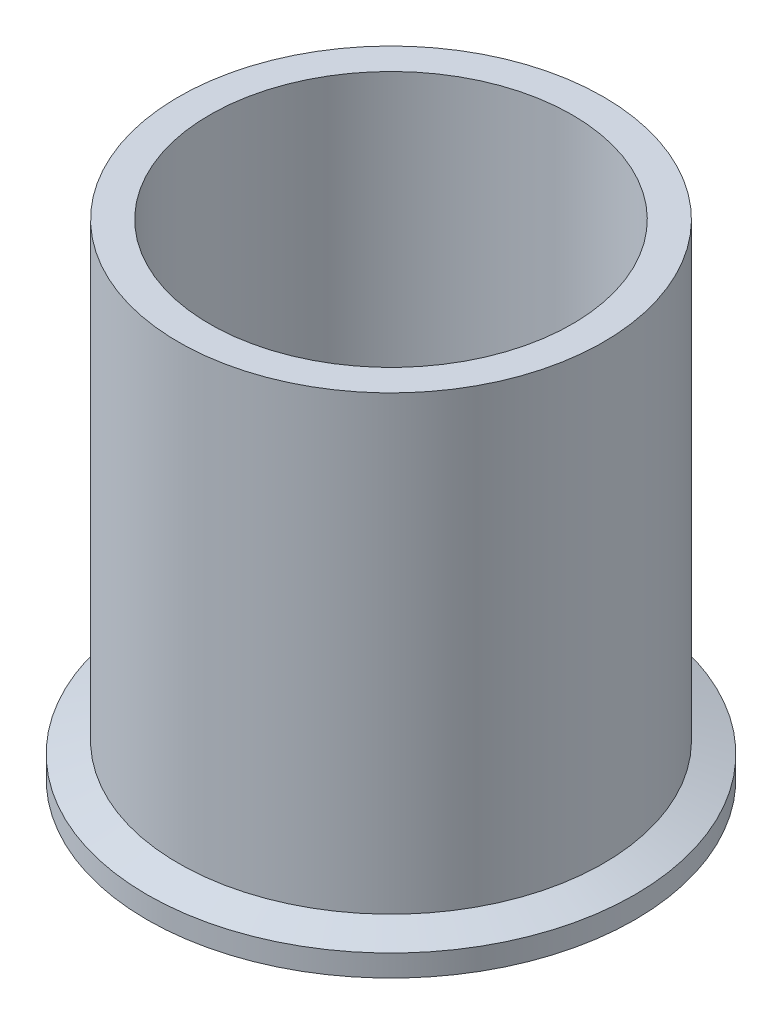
ISO-10303-21;
HEADER;
FILE_DESCRIPTION(('STEP AP214'),'2;1');
FILE_NAME('part.step','',(''),(''),'','','');
FILE_SCHEMA(('AUTOMOTIVE_DESIGN { 1 0 10303 214 1 1 1 1 }'));
ENDSEC;
DATA;
#1=APPLICATION_CONTEXT('core data for automotive mechanical design processes');
#2=APPLICATION_PROTOCOL_DEFINITION('international standard','automotive_design',2000,#1);
#3=PRODUCT_CONTEXT('',#1,'mechanical');
#4=PRODUCT('Part','Part','',(#3));
#5=PRODUCT_RELATED_PRODUCT_CATEGORY('part','',(#4));
#6=PRODUCT_DEFINITION_FORMATION('','',#4);
#7=PRODUCT_DEFINITION_CONTEXT('part definition',#1,'design');
#8=PRODUCT_DEFINITION('design','',#6,#7);
#9=PRODUCT_DEFINITION_SHAPE('','',#8);
#10=(LENGTH_UNIT() NAMED_UNIT(*) SI_UNIT(.MILLI.,.METRE.));
#11=(NAMED_UNIT(*) PLANE_ANGLE_UNIT() SI_UNIT($,.RADIAN.));
#12=(NAMED_UNIT(*) SI_UNIT($,.STERADIAN.) SOLID_ANGLE_UNIT());
#13=UNCERTAINTY_MEASURE_WITH_UNIT(LENGTH_MEASURE(1.E-05),#10,'distance_accuracy_value','');
#14=(GEOMETRIC_REPRESENTATION_CONTEXT(3) GLOBAL_UNCERTAINTY_ASSIGNED_CONTEXT((#13)) GLOBAL_UNIT_ASSIGNED_CONTEXT((#10,
#11,#12)) REPRESENTATION_CONTEXT('',''));
#15=CARTESIAN_POINT('',(0.,0.,0.));
#16=DIRECTION('',(0.,0.,1.));
#17=DIRECTION('',(1.,0.,0.));
#18=AXIS2_PLACEMENT_3D('',#15,#16,#17);
#19=CARTESIAN_POINT('',(0.,0.,0.));
#20=DIRECTION('',(0.,1.,0.));
#21=DIRECTION('',(0.,0.,1.));
#22=AXIS2_PLACEMENT_3D('',#19,#20,#21);
#23=PLANE('',#22);
#24=CARTESIAN_POINT('',(0.,0.,0.));
#25=DIRECTION('',(0.,-1.,0.));
#26=DIRECTION('',(0.,0.,-1.));
#27=AXIS2_PLACEMENT_3D('',#24,#25,#26);
#28=CIRCLE('',#27,29.9742414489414);
#29=CARTESIAN_POINT('',(0.,0.,-29.9742414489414));
#30=VERTEX_POINT('',#29);
#31=EDGE_CURVE('E10',#30,#30,#28,.T.);
#32=ORIENTED_EDGE('',*,*,#31,.F.);
#33=EDGE_LOOP('',(#32));
#34=FACE_BOUND('',#33,.T.);
#35=CARTESIAN_POINT('',(0.,0.,0.));
#36=DIRECTION('',(0.,-1.,0.));
#37=DIRECTION('',(0.,0.,-1.));
#38=AXIS2_PLACEMENT_3D('',#35,#36,#37);
#39=CIRCLE('',#38,31.9532);
#40=CARTESIAN_POINT('',(0.,0.,-31.9532));
#41=VERTEX_POINT('',#40);
#42=EDGE_CURVE('E73',#41,#41,#39,.T.);
#43=ORIENTED_EDGE('',*,*,#42,.T.);
#44=EDGE_LOOP('',(#43));
#45=FACE_BOUND('',#44,.T.);
#46=ADVANCED_FACE('F33',(#34,#45),#23,.F.);
#47=CARTESIAN_POINT('',(0.,0.508,0.));
#48=DIRECTION('',(0.,-1.,0.));
#49=DIRECTION('',(0.,0.,-1.));
#50=AXIS2_PLACEMENT_3D('',#47,#48,#49);
#51=TOROIDAL_SURFACE('',#50,29.9742414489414,0.507999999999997);
#52=CARTESIAN_POINT('',(0.,0.309508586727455,0.));
#53=DIRECTION('',(0.,-1.,0.));
#54=DIRECTION('',(0.,0.,-1.));
#55=AXIS2_PLACEMENT_3D('',#52,#53,#54);
#56=CIRCLE('',#55,29.5066249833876);
#57=CARTESIAN_POINT('',(0.,0.309508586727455,-29.5066249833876));
#58=VERTEX_POINT('',#57);
#59=EDGE_CURVE('E39',#58,#58,#56,.T.);
#60=ORIENTED_EDGE('',*,*,#59,.F.);
#61=EDGE_LOOP('',(#60));
#62=FACE_BOUND('',#61,.T.);
#63=ORIENTED_EDGE('',*,*,#31,.T.);
#64=EDGE_LOOP('',(#63));
#65=FACE_BOUND('',#64,.T.);
#66=ADVANCED_FACE('F114',(#62,#65),#51,.T.);
#67=CARTESIAN_POINT('',(0.,0.872854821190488,0.));
#68=DIRECTION('',(0.,-1.,0.));
#69=DIRECTION('',(0.,0.,-1.));
#70=AXIS2_PLACEMENT_3D('',#67,#68,#69);
#71=CONICAL_SURFACE('',#70,29.2674986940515,0.4014257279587);
#72=ORIENTED_EDGE('',*,*,#59,.T.);
#73=EDGE_LOOP('',(#72));
#74=FACE_BOUND('',#73,.T.);
#75=CARTESIAN_POINT('',(0.,0.872854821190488,0.));
#76=DIRECTION('',(0.,-1.,0.));
#77=DIRECTION('',(0.,0.,-1.));
#78=AXIS2_PLACEMENT_3D('',#75,#76,#77);
#79=CIRCLE('',#78,29.2674986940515);
#80=CARTESIAN_POINT('',(0.,0.872854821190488,-29.2674986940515));
#81=VERTEX_POINT('',#80);
#82=EDGE_CURVE('E43',#81,#81,#79,.T.);
#83=ORIENTED_EDGE('',*,*,#82,.F.);
#84=EDGE_LOOP('',(#83));
#85=FACE_BOUND('',#84,.T.);
#86=ADVANCED_FACE('F119',(#74,#85),#71,.F.);
#87=CARTESIAN_POINT('',(0.,0.4064,0.));
#88=DIRECTION('',(0.,-1.,0.));
#89=DIRECTION('',(0.,0.,-1.));
#90=AXIS2_PLACEMENT_3D('',#87,#88,#89);
#91=TOROIDAL_SURFACE('',#90,28.1686,1.1938);
#92=CARTESIAN_POINT('',(0.,0.872854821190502,0.));
#93=DIRECTION('',(0.,-1.,0.));
#94=DIRECTION('',(0.,0.,-1.));
#95=AXIS2_PLACEMENT_3D('',#92,#93,#94);
#96=CIRCLE('',#95,27.0697013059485);
#97=CARTESIAN_POINT('',(0.,0.872854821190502,-27.0697013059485));
#98=VERTEX_POINT('',#97);
#99=EDGE_CURVE('E47',#98,#98,#96,.T.);
#100=ORIENTED_EDGE('',*,*,#99,.F.);
#101=EDGE_LOOP('',(#100));
#102=FACE_BOUND('',#101,.T.);
#103=ORIENTED_EDGE('',*,*,#82,.T.);
#104=EDGE_LOOP('',(#103));
#105=FACE_BOUND('',#104,.T.);
#106=ADVANCED_FACE('F124',(#102,#105),#91,.F.);
#107=CARTESIAN_POINT('',(0.,0.872854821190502,0.));
#108=DIRECTION('',(0.,1.,0.));
#109=DIRECTION('',(0.,0.,1.));
#110=AXIS2_PLACEMENT_3D('',#107,#108,#109);
#111=CONICAL_SURFACE('',#110,27.0697013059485,0.401425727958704);
#112=CARTESIAN_POINT('',(0.,0.309508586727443,0.));
#113=DIRECTION('',(0.,-1.,0.));
#114=DIRECTION('',(0.,0.,-1.));
#115=AXIS2_PLACEMENT_3D('',#112,#113,#114);
#116=CIRCLE('',#115,26.8305750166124);
#117=CARTESIAN_POINT('',(0.,0.309508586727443,-26.8305750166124));
#118=VERTEX_POINT('',#117);
#119=EDGE_CURVE('E52',#118,#118,#116,.T.);
#120=ORIENTED_EDGE('',*,*,#119,.F.);
#121=EDGE_LOOP('',(#120));
#122=FACE_BOUND('',#121,.T.);
#123=ORIENTED_EDGE('',*,*,#99,.T.);
#124=EDGE_LOOP('',(#123));
#125=FACE_BOUND('',#124,.T.);
#126=ADVANCED_FACE('F129',(#122,#125),#111,.T.);
#127=CARTESIAN_POINT('',(0.,0.508,0.));
#128=DIRECTION('',(0.,-1.,0.));
#129=DIRECTION('',(0.,0.,-1.));
#130=AXIS2_PLACEMENT_3D('',#127,#128,#129);
#131=TOROIDAL_SURFACE('',#130,26.3629585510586,0.508000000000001);
#132=ORIENTED_EDGE('',*,*,#119,.T.);
#133=EDGE_LOOP('',(#132));
#134=FACE_BOUND('',#133,.T.);
#135=CARTESIAN_POINT('',(0.,0.,0.));
#136=DIRECTION('',(0.,-1.,0.));
#137=DIRECTION('',(0.,0.,-1.));
#138=AXIS2_PLACEMENT_3D('',#135,#136,#137);
#139=CIRCLE('',#138,26.3629585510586);
#140=CARTESIAN_POINT('',(0.,0.,-26.3629585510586));
#141=VERTEX_POINT('',#140);
#142=EDGE_CURVE('E55',#141,#141,#139,.T.);
#143=ORIENTED_EDGE('',*,*,#142,.F.);
#144=EDGE_LOOP('',(#143));
#145=FACE_BOUND('',#144,.T.);
#146=ADVANCED_FACE('F110',(#134,#145),#131,.T.);
#147=CARTESIAN_POINT('',(0.,0.,0.));
#148=DIRECTION('',(0.,1.,0.));
#149=DIRECTION('',(0.,0.,1.));
#150=AXIS2_PLACEMENT_3D('',#147,#148,#149);
#151=PLANE('',#150);
#152=CARTESIAN_POINT('',(0.,0.,0.));
#153=DIRECTION('',(0.,-1.,0.));
#154=DIRECTION('',(0.,0.,-1.));
#155=AXIS2_PLACEMENT_3D('',#152,#153,#154);
#156=CIRCLE('',#155,23.749);
#157=CARTESIAN_POINT('',(0.,0.,-23.749));
#158=VERTEX_POINT('',#157);
#159=EDGE_CURVE('E58',#158,#158,#156,.T.);
#160=ORIENTED_EDGE('',*,*,#159,.F.);
#161=EDGE_LOOP('',(#160));
#162=FACE_BOUND('',#161,.T.);
#163=ORIENTED_EDGE('',*,*,#142,.T.);
#164=EDGE_LOOP('',(#163));
#165=FACE_BOUND('',#164,.T.);
#166=ADVANCED_FACE('F104',(#162,#165),#151,.F.);
#167=CARTESIAN_POINT('',(0.,0.,0.));
#168=DIRECTION('',(0.,-1.,0.));
#169=DIRECTION('',(0.,0.,-1.));
#170=AXIS2_PLACEMENT_3D('',#167,#168,#169);
#171=CYLINDRICAL_SURFACE('',#170,23.749);
#172=ORIENTED_EDGE('',*,*,#159,.T.);
#173=EDGE_LOOP('',(#172));
#174=FACE_BOUND('',#173,.T.);
#175=CARTESIAN_POINT('',(0.,63.5,0.));
#176=DIRECTION('',(0.,-1.,0.));
#177=DIRECTION('',(0.,0.,-1.));
#178=AXIS2_PLACEMENT_3D('',#175,#176,#177);
#179=CIRCLE('',#178,23.749);
#180=CARTESIAN_POINT('',(0.,63.5,-23.749));
#181=VERTEX_POINT('',#180);
#182=EDGE_CURVE('E61',#181,#181,#179,.T.);
#183=ORIENTED_EDGE('',*,*,#182,.F.);
#184=EDGE_LOOP('',(#183));
#185=FACE_BOUND('',#184,.T.);
#186=ADVANCED_FACE('F99',(#174,#185),#171,.F.);
#187=CARTESIAN_POINT('',(0.,63.5,0.));
#188=DIRECTION('',(0.,-1.,0.));
#189=DIRECTION('',(0.,0.,-1.));
#190=AXIS2_PLACEMENT_3D('',#187,#188,#189);
#191=PLANE('',#190);
#192=CARTESIAN_POINT('',(0.,63.5,0.));
#193=DIRECTION('',(0.,-1.,0.));
#194=DIRECTION('',(0.,0.,-1.));
#195=AXIS2_PLACEMENT_3D('',#192,#193,#194);
#196=CIRCLE('',#195,27.8384);
#197=CARTESIAN_POINT('',(0.,63.5,-27.8384));
#198=VERTEX_POINT('',#197);
#199=EDGE_CURVE('E64',#198,#198,#196,.T.);
#200=ORIENTED_EDGE('',*,*,#199,.F.);
#201=EDGE_LOOP('',(#200));
#202=FACE_BOUND('',#201,.T.);
#203=ORIENTED_EDGE('',*,*,#182,.T.);
#204=EDGE_LOOP('',(#203));
#205=FACE_BOUND('',#204,.T.);
#206=ADVANCED_FACE('F93',(#202,#205),#191,.F.);
#207=CARTESIAN_POINT('',(0.,0.,0.));
#208=DIRECTION('',(0.,-1.,0.));
#209=DIRECTION('',(0.,0.,-1.));
#210=AXIS2_PLACEMENT_3D('',#207,#208,#209);
#211=CYLINDRICAL_SURFACE('',#210,27.8384);
#212=CARTESIAN_POINT('',(0.,4.34246471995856,0.));
#213=DIRECTION('',(0.,-1.,0.));
#214=DIRECTION('',(0.,0.,-1.));
#215=AXIS2_PLACEMENT_3D('',#212,#213,#214);
#216=CIRCLE('',#215,27.8384);
#217=CARTESIAN_POINT('',(0.,4.34246471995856,-27.8384));
#218=VERTEX_POINT('',#217);
#219=EDGE_CURVE('E67',#218,#218,#216,.T.);
#220=ORIENTED_EDGE('',*,*,#219,.F.);
#221=EDGE_LOOP('',(#220));
#222=FACE_BOUND('',#221,.T.);
#223=ORIENTED_EDGE('',*,*,#199,.T.);
#224=EDGE_LOOP('',(#223));
#225=FACE_BOUND('',#224,.T.);
#226=ADVANCED_FACE('F87',(#222,#225),#211,.T.);
#227=CARTESIAN_POINT('',(0.,4.34246471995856,0.));
#228=DIRECTION('',(0.,-1.,0.));
#229=DIRECTION('',(0.,0.,-1.));
#230=AXIS2_PLACEMENT_3D('',#227,#228,#229);
#231=CONICAL_SURFACE('',#230,27.8384,1.22173047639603);
#232=CARTESIAN_POINT('',(0.,2.8448,0.));
#233=DIRECTION('',(0.,-1.,0.));
#234=DIRECTION('',(0.,0.,-1.));
#235=AXIS2_PLACEMENT_3D('',#232,#233,#234);
#236=CIRCLE('',#235,31.9532);
#237=CARTESIAN_POINT('',(0.,2.8448,-31.9532));
#238=VERTEX_POINT('',#237);
#239=EDGE_CURVE('E70',#238,#238,#236,.T.);
#240=ORIENTED_EDGE('',*,*,#239,.F.);
#241=EDGE_LOOP('',(#240));
#242=FACE_BOUND('',#241,.T.);
#243=ORIENTED_EDGE('',*,*,#219,.T.);
#244=EDGE_LOOP('',(#243));
#245=FACE_BOUND('',#244,.T.);
#246=ADVANCED_FACE('F81',(#242,#245),#231,.T.);
#247=CARTESIAN_POINT('',(0.,0.,0.));
#248=DIRECTION('',(0.,-1.,0.));
#249=DIRECTION('',(0.,0.,-1.));
#250=AXIS2_PLACEMENT_3D('',#247,#248,#249);
#251=CYLINDRICAL_SURFACE('',#250,31.9532);
#252=ORIENTED_EDGE('',*,*,#42,.F.);
#253=EDGE_LOOP('',(#252));
#254=FACE_BOUND('',#253,.T.);
#255=ORIENTED_EDGE('',*,*,#239,.T.);
#256=EDGE_LOOP('',(#255));
#257=FACE_BOUND('',#256,.T.);
#258=ADVANCED_FACE('F78',(#254,#257),#251,.T.);
#259=CLOSED_SHELL('',(#46,#66,#86,#106,#126,#146,#166,#186,#206,#226,#246,#258));
#260=MANIFOLD_SOLID_BREP('B2',#259);
#261=ADVANCED_BREP_SHAPE_REPRESENTATION('',(#18,#260),#14);
#262=SHAPE_DEFINITION_REPRESENTATION(#9,#261);
ENDSEC;
END-ISO-10303-21;
